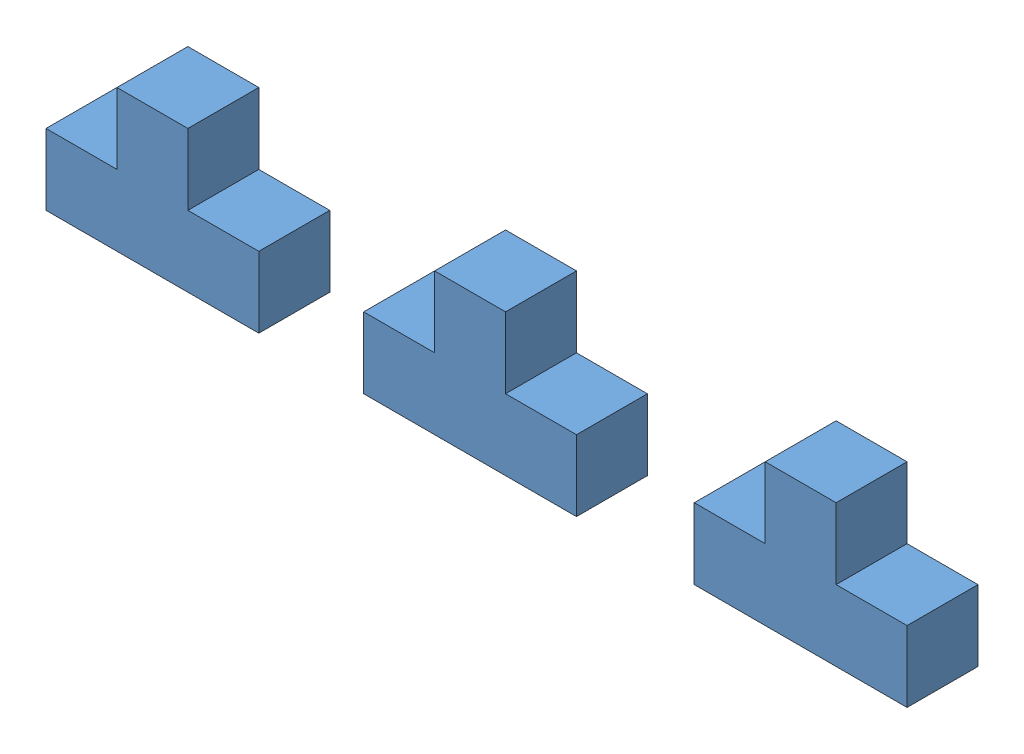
SolidWorks assembly Baugruppe1.SLDASM, configuration Default (file format 3800). Lengths in mm.
Overall size (616.63 101.6 50.8).
3 component instances, 1 part files, 6 mates.
Components (placement in the parent):
- T Block-1: T Block.SLDPRT [Default] at (-42.8857 0 -25.4) size (152.4 101.6 50.8)
- T Block-2: T Block.SLDPRT [Default] at (184.6062 0 -25.4) size (152.4 101.6 50.8)
- T Block-3: T Block.SLDPRT [Default] at (421.3402 0 -25.4) size (152.4 101.6 50.8)
Mates (geometry in assembly coordinates):
- Deckungsgleich2: coincident: plane of ? through (-42.8857 0 38.0509) normal (0 -1 0)
- Deckungsgleich3: coincident: unknown of ?
- Deckungsgleich4: coincident: unknown of ?
- Deckungsgleich5: coincident aligned: unknown of ?
- Deckungsgleich6: coincident: unknown of ?
- Deckungsgleich7: coincident anti-aligned: unknown of ?
